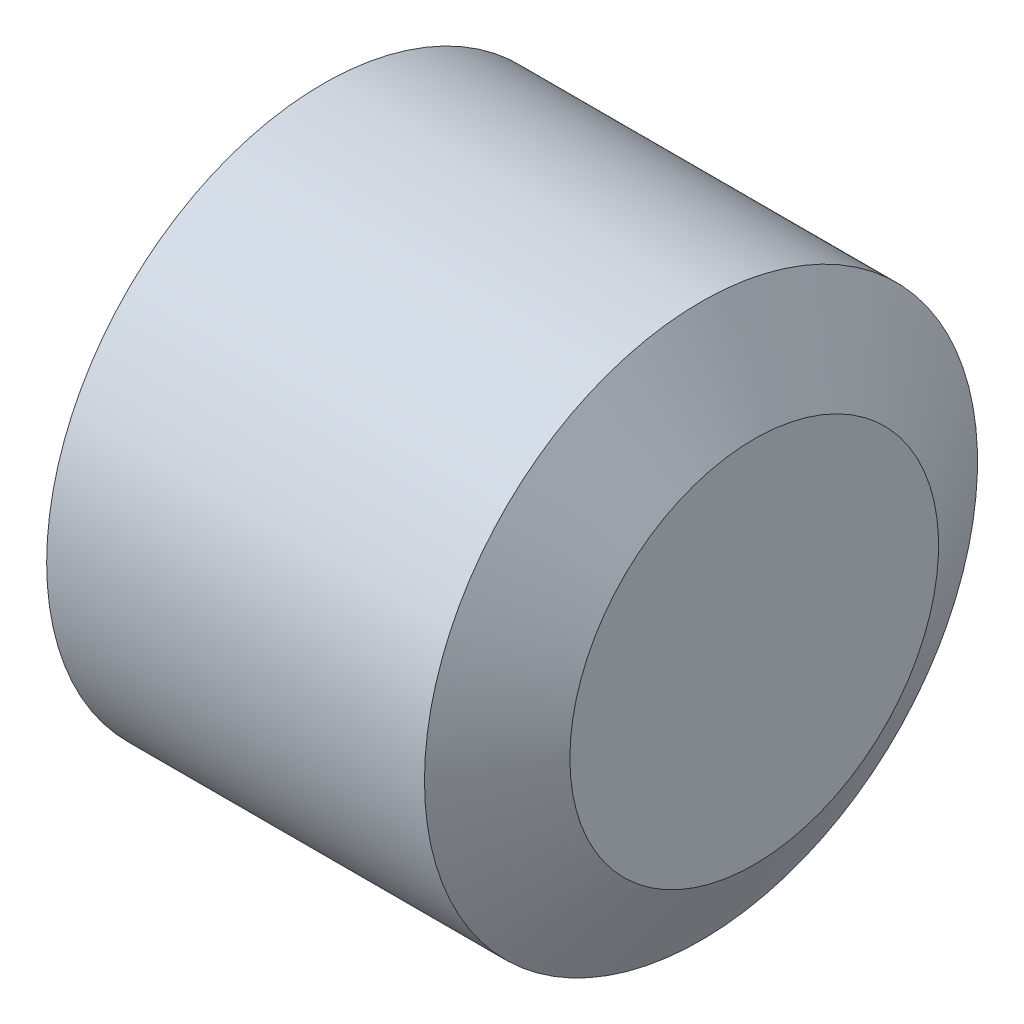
from build123d import *

# Parameters (mm, degrees)
HEX_2_DEPTH = 1.1


with BuildPart() as part:
    # BodySke → BaseBody (revolve)
    with BuildSketch(Plane.XY, mode=Mode.PRIVATE) as basebody_sk:
        Polygon((0, 0), (0, 1.2195), (0.161946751, 1.5), (2.211324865, 1.5), (2.5, 1), (2.5, 0), align=None)
    revolve(basebody_sk.sketch.rotate(Axis((-12.7, 0, 0), (1, 0, 0)), 90), axis=Axis((-12.7, 0, 0), (1, 0, 0)))

    # Sketch2 → Hex 2 (cut)
    with BuildSketch(Plane.ZY):
        Polygon((0.433012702, 0.75), (-0.433012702, 0.75), (-0.866025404, 0), (-0.433012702, -0.75), (0.433012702, -0.75), (0.866025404, 0), align=None)
    extrude(amount=-HEX_2_DEPTH, mode=Mode.SUBTRACT)


solid = part.part
